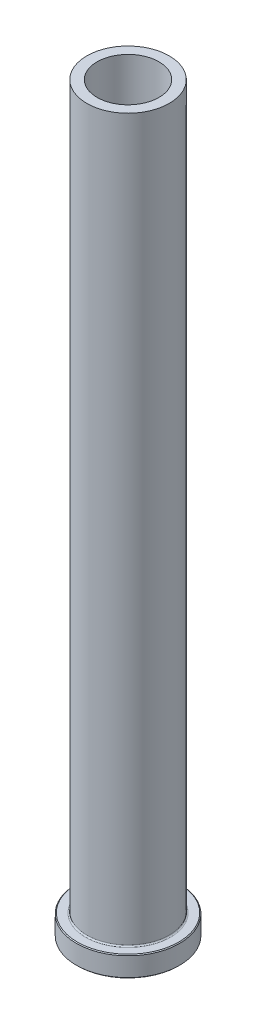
from build123d import *

# Parameters (mm, degrees)
CHAMFER1_SIZE = 0.254


with BuildPart() as part:
    # Sketch1 → Revolve1 (revolve)
    with BuildSketch(Plane.XY, mode=Mode.PRIVATE) as revolve1_sk:
        with BuildLine():
            Line((0, 0), (15.875, 0))
            Line((15.875, 0), (15.875, 6.35))
            Line((15.875, 6.35), (13.090525, 6.35))
            ThreePointArc((13.090525, 6.35), (12.809891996, 6.466241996), (12.69365, 6.746875))
            Line((12.69365, 6.746875), (12.69365, 228.6))
            Line((12.69365, 228.6), (0, 228.6))
            Line((0, 228.6), (0, 0))
        make_face()
    revolve(revolve1_sk.sketch.rotate(Axis((0, 0, 0), (0, 1, 0)), 90), axis=Axis((0, 0, 0), (0, 1, 0)))

    # Sketch2 → Cut-Revolve1 (revolve, cut)
    with BuildSketch(Plane.XY, mode=Mode.PRIVATE) as cut_revolve1_sk:
        Polygon((10.112375, 0), (9.7155, 0.396875), (9.7155, 154.1145), (9.525, 168.402), (9.525, 228.6), (0, 228.6), (0, 0), align=None)
    revolve(cut_revolve1_sk.sketch.rotate(Axis((0, 0, 0), (0, 1, 0)), 90), axis=Axis((0, 0, 0), (0, 1, 0)), mode=Mode.SUBTRACT)

    # Chamfer1
    chamfer1_edges = [part.edges().sort_by_distance(p)[0] for p in [
        (0, 6.35, 15.875),
        (0, 0, 15.875),
    ]]
    chamfer(chamfer1_edges, length=CHAMFER1_SIZE)


solid = part.part
